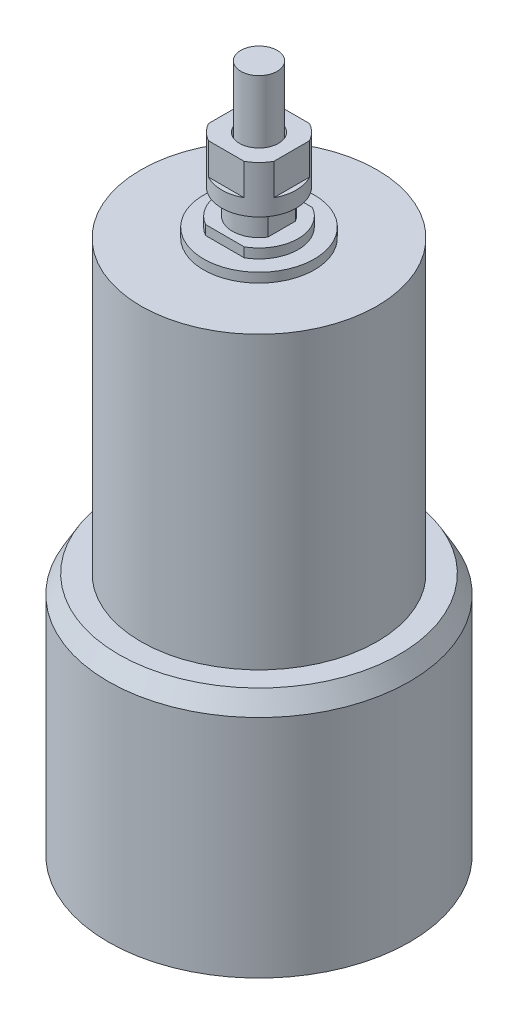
from build123d import *
from OCP.BRepFilletAPI import BRepFilletAPI_MakeChamfer

# Parameters (mm, degrees)
SKETCH1_R          = 41.275
EXTRUDE1_DEPTH     = 101.6
SKETCH2_R          = 19.3675
EXTRUDE2_DEPTH     = 3.302
EXTRUDE3_DEPTH     = 3.3274
EXTRUDE4_DEPTH     = 8.89
SKETCH5_R          = 13.0175
SKETCH5_R_2        = 6.8199
EXTRUDE5_DEPTH     = 16.51
SKETCH6_R          = 25.4
SKETCH6_W          = 22.86
SKETCH6_H          = 22.86
CUT_EXTRUDE1_DEPTH = 11.0236
SKETCH7_R          = 52.705
EXTRUDE6_DEPTH     = 88.9
SKETCH8_R          = 6.35
EXTRUDE7_DEPTH     = 38.1
CHAMFER1_SIZE      = 6.35
CHAMFER1_SIZE2     = 3.666174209


with BuildPart() as part:
    # Sketch1 → Extrude1 (new body)
    with BuildSketch(Plane(origin=(0, 0, 0), x_dir=(1, 0, 0), z_dir=(0, 1, 0))):
        with Locations(Location((0, 0, 0), (0, 0, 270))):
            Circle(SKETCH1_R)
    extrude(amount=EXTRUDE1_DEPTH)

    # Sketch2 → Extrude2 (add)
    with BuildSketch(Plane(origin=(0, 101.6, 0), x_dir=(-1, 0, 0), z_dir=(0, 1, 0))):
        with Locations(Location((0, 0, 0), (0, 0, 270))):
            Circle(SKETCH2_R)
    extrude(amount=EXTRUDE2_DEPTH)

    # Sketch3 → Extrude3 (add)
    with BuildSketch(Plane(origin=(0, 104.902, 0), x_dir=(-1, 0, 0), z_dir=(0, 1, 0))):
        with BuildLine():
            Line((-6.747035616, -11.9126), (6.747035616, -11.9126))
            ThreePointArc((6.747035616, -11.9126), (13.6906, 0), (6.747035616, 11.9126))
            Line((6.747035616, 11.9126), (-6.747035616, 11.9126))
            ThreePointArc((-6.747035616, 11.9126), (-13.6906, 0), (-6.747035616, -11.9126))
        make_face()
    extrude(amount=EXTRUDE3_DEPTH)

    # Sketch4 → Extrude4 (add)
    with BuildSketch(Plane(origin=(0, 108.2294, 0), x_dir=(-1, 0, 0), z_dir=(0, 1, 0))):
        with BuildLine():
            Line((-7.9375, -4.79035852), (-7.9375, 4.79035852))
            ThreePointArc((-7.9375, 4.79035852), (0, 9.271), (7.9375, 4.79035852))
            Line((7.9375, 4.79035852), (7.9375, -4.79035852))
            ThreePointArc((7.9375, -4.79035852), (0, -9.271), (-7.9375, -4.79035852))
        make_face()
    extrude(amount=EXTRUDE4_DEPTH)

    # Sketch5 → Extrude5 (add)
    with BuildSketch(Plane(origin=(0, 117.1194, 0), x_dir=(-1, 0, 0), z_dir=(0, 1, 0))):
        with Locations(Location((0, 0, 0), (0, 0, 90))):
            Circle(SKETCH5_R)
        with Locations(Location((0, 0, 0), (0, 0, 90))):
            Circle(SKETCH5_R_2, mode=Mode.SUBTRACT)
    extrude(amount=EXTRUDE5_DEPTH)

    # Sketch6 → Cut-Extrude1 (cut)
    with BuildSketch(Plane(origin=(0, 133.6294, 0), x_dir=(-1, 0, 0), z_dir=(0, 1, 0))):
        Circle(SKETCH6_R)
        Rectangle(SKETCH6_W, SKETCH6_H, mode=Mode.SUBTRACT)
    extrude(amount=-CUT_EXTRUDE1_DEPTH, mode=Mode.SUBTRACT)

    # Sketch7 → Extrude6 (add)
    with BuildSketch(Plane.XZ):
        with Locations(Location((0, 0, 0), (0, 0, 270))):
            Circle(SKETCH7_R)
    extrude(amount=EXTRUDE6_DEPTH)

    # Sketch8 → Extrude7 (add)
    with BuildSketch(Plane(origin=(0, 117.1194, 0), x_dir=(-1, 0, 0), z_dir=(0, 1, 0))):
        with Locations(Location((0, 0, 0), (0, 0, 270))):
            Circle(SKETCH8_R)
    extrude(amount=EXTRUDE7_DEPTH)

    # Chamfer1: one chamfer whose edges measure the first distance from different faces: ONE call of the kernel's chamfer builder (chamfer() names one face for all edges)
    chamfer1_edges_1 = [part.edges().sort_by_distance(p)[0] for p in [
        (0, 0, 52.705),
    ]]
    chamfer1_side_1 = [part.faces().sort_by_distance(p)[0] for p in [
        (0, -44.45, 52.705),
    ]]
    chamfer1_edges_2 = [part.edges().sort_by_distance(p)[0] for p in [
        (0, -88.9, 52.705),
    ]]
    chamfer1_side_2 = [part.faces().sort_by_distance(p)[0] for p in [
        (0, -88.9, 0),
    ]]
    chamfer1 = BRepFilletAPI_MakeChamfer(part.part.solid().wrapped)
    for e in chamfer1_edges_1:
        chamfer1.Add(CHAMFER1_SIZE, CHAMFER1_SIZE2, e.wrapped, chamfer1_side_1[0].wrapped)  # the first distance lies on this face
    for e in chamfer1_edges_2:
        chamfer1.Add(CHAMFER1_SIZE, CHAMFER1_SIZE2, e.wrapped, chamfer1_side_2[0].wrapped)  # the first distance lies on this face
    add(Compound.cast(chamfer1.Shape()), mode=Mode.REPLACE)


solid = part.part
